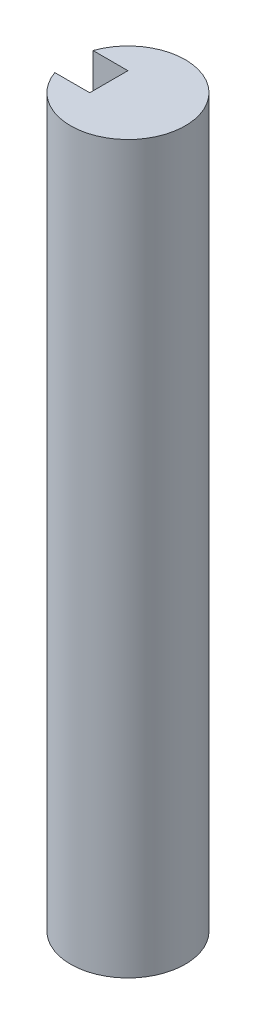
ISO-10303-21;
HEADER;
FILE_DESCRIPTION(('STEP AP214'),'2;1');
FILE_NAME('part.step','',(''),(''),'','','');
FILE_SCHEMA(('AUTOMOTIVE_DESIGN { 1 0 10303 214 1 1 1 1 }'));
ENDSEC;
DATA;
#1=APPLICATION_CONTEXT('core data for automotive mechanical design processes');
#2=APPLICATION_PROTOCOL_DEFINITION('international standard','automotive_design',2000,#1);
#3=PRODUCT_CONTEXT('',#1,'mechanical');
#4=PRODUCT('Part','Part','',(#3));
#5=PRODUCT_RELATED_PRODUCT_CATEGORY('part','',(#4));
#6=PRODUCT_DEFINITION_FORMATION('','',#4);
#7=PRODUCT_DEFINITION_CONTEXT('part definition',#1,'design');
#8=PRODUCT_DEFINITION('design','',#6,#7);
#9=PRODUCT_DEFINITION_SHAPE('','',#8);
#10=(LENGTH_UNIT() NAMED_UNIT(*) SI_UNIT(.MILLI.,.METRE.));
#11=(NAMED_UNIT(*) PLANE_ANGLE_UNIT() SI_UNIT($,.RADIAN.));
#12=(NAMED_UNIT(*) SI_UNIT($,.STERADIAN.) SOLID_ANGLE_UNIT());
#13=UNCERTAINTY_MEASURE_WITH_UNIT(LENGTH_MEASURE(1.E-05),#10,'distance_accuracy_value','');
#14=(GEOMETRIC_REPRESENTATION_CONTEXT(3) GLOBAL_UNCERTAINTY_ASSIGNED_CONTEXT((#13)) GLOBAL_UNIT_ASSIGNED_CONTEXT((#10,
#11,#12)) REPRESENTATION_CONTEXT('',''));
#15=CARTESIAN_POINT('',(0.,0.,0.));
#16=DIRECTION('',(0.,0.,1.));
#17=DIRECTION('',(1.,0.,0.));
#18=AXIS2_PLACEMENT_3D('',#15,#16,#17);
#19=CARTESIAN_POINT('',(1.5,19.,0.));
#20=DIRECTION('',(0.,-1.,0.));
#21=DIRECTION('',(0.,0.,-1.));
#22=AXIS2_PLACEMENT_3D('',#19,#20,#21);
#23=CYLINDRICAL_SURFACE('',#22,1.5);
#24=CARTESIAN_POINT('',(1.5,10.5,0.));
#25=DIRECTION('',(0.,-1.,0.));
#26=DIRECTION('',(0.,0.,-1.));
#27=AXIS2_PLACEMENT_3D('',#24,#25,#26);
#28=CIRCLE('',#27,1.5);
#29=CARTESIAN_POINT('',(0.0857864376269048,10.5,0.5));
#30=VERTEX_POINT('',#29);
#31=CARTESIAN_POINT('',(0.0857864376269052,10.5,-0.5));
#32=VERTEX_POINT('',#31);
#33=EDGE_CURVE('E201',#30,#32,#28,.T.);
#34=ORIENTED_EDGE('',*,*,#33,.F.);
#35=DIRECTION('',(0.,-1.,0.));
#36=VECTOR('',#35,1.);
#37=CARTESIAN_POINT('',(0.0857864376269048,19.,0.5));
#38=LINE('',#37,#36);
#39=CARTESIAN_POINT('',(0.0857864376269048,9.00000000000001,0.5));
#40=VERTEX_POINT('',#39);
#41=EDGE_CURVE('E210',#30,#40,#38,.T.);
#42=ORIENTED_EDGE('',*,*,#41,.T.);
#43=CARTESIAN_POINT('',(1.5,9.00000000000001,0.));
#44=DIRECTION('',(0.,-1.,0.));
#45=DIRECTION('',(0.,0.,-1.));
#46=AXIS2_PLACEMENT_3D('',#43,#44,#45);
#47=CIRCLE('',#46,1.5);
#48=CARTESIAN_POINT('',(0.0857864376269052,9.00000000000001,-0.5));
#49=VERTEX_POINT('',#48);
#50=EDGE_CURVE('E207',#40,#49,#47,.T.);
#51=ORIENTED_EDGE('',*,*,#50,.T.);
#52=DIRECTION('',(0.,-1.,0.));
#53=VECTOR('',#52,1.);
#54=CARTESIAN_POINT('',(0.0857864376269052,19.,-0.5));
#55=LINE('',#54,#53);
#56=EDGE_CURVE('E205',#32,#49,#55,.T.);
#57=ORIENTED_EDGE('',*,*,#56,.F.);
#58=EDGE_LOOP('',(#34,#42,#51,#57));
#59=FACE_BOUND('',#58,.T.);
#60=CARTESIAN_POINT('',(1.5,0.,0.));
#61=DIRECTION('',(0.,1.,0.));
#62=DIRECTION('',(0.,0.,1.));
#63=AXIS2_PLACEMENT_3D('',#60,#61,#62);
#64=CIRCLE('',#63,1.5);
#65=CARTESIAN_POINT('',(1.5,0.,1.5));
#66=VERTEX_POINT('',#65);
#67=EDGE_CURVE('E197',#66,#66,#64,.T.);
#68=ORIENTED_EDGE('',*,*,#67,.T.);
#69=EDGE_LOOP('',(#68));
#70=FACE_BOUND('',#69,.T.);
#71=CARTESIAN_POINT('',(1.5,13.5,0.));
#72=DIRECTION('',(0.,-1.,0.));
#73=DIRECTION('',(0.,0.,-1.));
#74=AXIS2_PLACEMENT_3D('',#71,#72,#73);
#75=CIRCLE('',#74,1.5);
#76=CARTESIAN_POINT('',(0.0857864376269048,13.5,0.5));
#77=VERTEX_POINT('',#76);
#78=CARTESIAN_POINT('',(0.0857864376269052,13.5,-0.5));
#79=VERTEX_POINT('',#78);
#80=EDGE_CURVE('E213',#77,#79,#75,.T.);
#81=ORIENTED_EDGE('',*,*,#80,.F.);
#82=DIRECTION('',(0.,-1.,0.));
#83=VECTOR('',#82,1.);
#84=CARTESIAN_POINT('',(0.0857864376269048,19.,0.5));
#85=LINE('',#84,#83);
#86=CARTESIAN_POINT('',(0.0857864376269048,12.,0.5));
#87=VERTEX_POINT('',#86);
#88=EDGE_CURVE('E44',#77,#87,#85,.T.);
#89=ORIENTED_EDGE('',*,*,#88,.T.);
#90=CARTESIAN_POINT('',(1.5,12.,0.));
#91=DIRECTION('',(0.,-1.,0.));
#92=DIRECTION('',(0.,0.,-1.));
#93=AXIS2_PLACEMENT_3D('',#90,#91,#92);
#94=CIRCLE('',#93,1.5);
#95=CARTESIAN_POINT('',(0.0857864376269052,12.,-0.5));
#96=VERTEX_POINT('',#95);
#97=EDGE_CURVE('E59',#87,#96,#94,.T.);
#98=ORIENTED_EDGE('',*,*,#97,.T.);
#99=DIRECTION('',(0.,-1.,0.));
#100=VECTOR('',#99,1.);
#101=CARTESIAN_POINT('',(0.0857864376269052,19.,-0.5));
#102=LINE('',#101,#100);
#103=EDGE_CURVE('E215',#79,#96,#102,.T.);
#104=ORIENTED_EDGE('',*,*,#103,.F.);
#105=EDGE_LOOP('',(#81,#89,#98,#104));
#106=FACE_BOUND('',#105,.T.);
#107=CARTESIAN_POINT('',(1.5,17.5,0.));
#108=DIRECTION('',(0.,1.,0.));
#109=DIRECTION('',(0.,0.,1.));
#110=AXIS2_PLACEMENT_3D('',#107,#108,#109);
#111=CIRCLE('',#110,1.5);
#112=CARTESIAN_POINT('',(0.085786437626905,17.5,-0.5));
#113=VERTEX_POINT('',#112);
#114=CARTESIAN_POINT('',(0.0857864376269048,17.5,0.5));
#115=VERTEX_POINT('',#114);
#116=EDGE_CURVE('E11',#113,#115,#111,.T.);
#117=ORIENTED_EDGE('',*,*,#116,.F.);
#118=DIRECTION('',(0.,-1.,0.));
#119=VECTOR('',#118,1.);
#120=CARTESIAN_POINT('',(0.085786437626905,19.,-0.5));
#121=LINE('',#120,#119);
#122=CARTESIAN_POINT('',(0.085786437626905,19.,-0.5));
#123=VERTEX_POINT('',#122);
#124=EDGE_CURVE('E150',#113,#123,#121,.F.);
#125=ORIENTED_EDGE('',*,*,#124,.T.);
#126=CARTESIAN_POINT('',(1.5,19.,0.));
#127=DIRECTION('',(0.,1.,0.));
#128=DIRECTION('',(0.,0.,1.));
#129=AXIS2_PLACEMENT_3D('',#126,#127,#128);
#130=CIRCLE('',#129,1.5);
#131=CARTESIAN_POINT('',(0.085786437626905,19.,0.5));
#132=VERTEX_POINT('',#131);
#133=EDGE_CURVE('E198',#132,#123,#130,.T.);
#134=ORIENTED_EDGE('',*,*,#133,.F.);
#135=DIRECTION('',(0.,-1.,0.));
#136=VECTOR('',#135,1.);
#137=CARTESIAN_POINT('',(0.085786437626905,19.,0.5));
#138=LINE('',#137,#136);
#139=EDGE_CURVE('E153',#115,#132,#138,.F.);
#140=ORIENTED_EDGE('',*,*,#139,.F.);
#141=EDGE_LOOP('',(#117,#125,#134,#140));
#142=FACE_BOUND('',#141,.T.);
#143=ADVANCED_FACE('F37',(#59,#70,#106,#142),#23,.T.);
#144=CARTESIAN_POINT('',(1.5,19.,0.));
#145=DIRECTION('',(0.,1.,0.));
#146=DIRECTION('',(0.,0.,1.));
#147=AXIS2_PLACEMENT_3D('',#144,#145,#146);
#148=PLANE('',#147);
#149=DIRECTION('',(0.,0.,-1.));
#150=VECTOR('',#149,1.);
#151=CARTESIAN_POINT('',(1.,19.,0.5));
#152=LINE('',#151,#150);
#153=CARTESIAN_POINT('',(1.,19.,0.5));
#154=VERTEX_POINT('',#153);
#155=CARTESIAN_POINT('',(1.,19.,-0.5));
#156=VERTEX_POINT('',#155);
#157=EDGE_CURVE('E145',#154,#156,#152,.T.);
#158=ORIENTED_EDGE('',*,*,#157,.F.);
#159=DIRECTION('',(-1.,0.,0.));
#160=VECTOR('',#159,1.);
#161=CARTESIAN_POINT('',(1.,19.,0.5));
#162=LINE('',#161,#160);
#163=EDGE_CURVE('E130',#154,#132,#162,.T.);
#164=ORIENTED_EDGE('',*,*,#163,.T.);
#165=ORIENTED_EDGE('',*,*,#133,.T.);
#166=DIRECTION('',(-1.,0.,0.));
#167=VECTOR('',#166,1.);
#168=CARTESIAN_POINT('',(1.,19.,-0.5));
#169=LINE('',#168,#167);
#170=EDGE_CURVE('E133',#156,#123,#169,.T.);
#171=ORIENTED_EDGE('',*,*,#170,.F.);
#172=EDGE_LOOP('',(#158,#164,#165,#171));
#173=FACE_BOUND('',#172,.T.);
#174=ADVANCED_FACE('F248',(#173),#148,.T.);
#175=CARTESIAN_POINT('',(1.5,0.,0.));
#176=DIRECTION('',(0.,1.,0.));
#177=DIRECTION('',(0.,0.,1.));
#178=AXIS2_PLACEMENT_3D('',#175,#176,#177);
#179=PLANE('',#178);
#180=ORIENTED_EDGE('',*,*,#67,.F.);
#181=EDGE_LOOP('',(#180));
#182=FACE_BOUND('',#181,.T.);
#183=ADVANCED_FACE('F253',(#182),#179,.F.);
#184=CARTESIAN_POINT('',(1.,0.,0.5));
#185=DIRECTION('',(0.,0.,1.));
#186=DIRECTION('',(1.,0.,0.));
#187=AXIS2_PLACEMENT_3D('',#184,#185,#186);
#188=PLANE('',#187);
#189=DIRECTION('',(-1.,0.,0.));
#190=VECTOR('',#189,1.);
#191=CARTESIAN_POINT('',(1.,10.5,0.5));
#192=LINE('',#191,#190);
#193=CARTESIAN_POINT('',(1.,10.5,0.5));
#194=VERTEX_POINT('',#193);
#195=EDGE_CURVE('E185',#194,#30,#192,.T.);
#196=ORIENTED_EDGE('',*,*,#195,.F.);
#197=DIRECTION('',(0.,1.,0.));
#198=VECTOR('',#197,1.);
#199=CARTESIAN_POINT('',(1.,0.,0.5));
#200=LINE('',#199,#198);
#201=CARTESIAN_POINT('',(1.,9.00000000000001,0.5));
#202=VERTEX_POINT('',#201);
#203=EDGE_CURVE('E175',#202,#194,#200,.T.);
#204=ORIENTED_EDGE('',*,*,#203,.F.);
#205=DIRECTION('',(-1.,0.,0.));
#206=VECTOR('',#205,1.);
#207=CARTESIAN_POINT('',(1.,9.00000000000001,0.5));
#208=LINE('',#207,#206);
#209=EDGE_CURVE('E194',#202,#40,#208,.T.);
#210=ORIENTED_EDGE('',*,*,#209,.T.);
#211=ORIENTED_EDGE('',*,*,#41,.F.);
#212=EDGE_LOOP('',(#196,#204,#210,#211));
#213=FACE_BOUND('',#212,.T.);
#214=ADVANCED_FACE('F262',(#213),#188,.F.);
#215=CARTESIAN_POINT('',(1.,9.00000000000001,0.));
#216=DIRECTION('',(0.,-1.,0.));
#217=DIRECTION('',(0.,0.,-1.));
#218=AXIS2_PLACEMENT_3D('',#215,#216,#217);
#219=PLANE('',#218);
#220=ORIENTED_EDGE('',*,*,#209,.F.);
#221=DIRECTION('',(0.,0.,1.));
#222=VECTOR('',#221,1.);
#223=CARTESIAN_POINT('',(1.,9.00000000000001,0.));
#224=LINE('',#223,#222);
#225=CARTESIAN_POINT('',(1.,9.00000000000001,-0.5));
#226=VERTEX_POINT('',#225);
#227=EDGE_CURVE('E178',#226,#202,#224,.T.);
#228=ORIENTED_EDGE('',*,*,#227,.F.);
#229=DIRECTION('',(-1.,0.,0.));
#230=VECTOR('',#229,1.);
#231=CARTESIAN_POINT('',(1.,9.00000000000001,-0.5));
#232=LINE('',#231,#230);
#233=EDGE_CURVE('E191',#226,#49,#232,.T.);
#234=ORIENTED_EDGE('',*,*,#233,.T.);
#235=ORIENTED_EDGE('',*,*,#50,.F.);
#236=EDGE_LOOP('',(#220,#228,#234,#235));
#237=FACE_BOUND('',#236,.T.);
#238=ADVANCED_FACE('F266',(#237),#219,.F.);
#239=CARTESIAN_POINT('',(1.,0.,-0.5));
#240=DIRECTION('',(0.,0.,1.));
#241=DIRECTION('',(1.,0.,0.));
#242=AXIS2_PLACEMENT_3D('',#239,#240,#241);
#243=PLANE('',#242);
#244=ORIENTED_EDGE('',*,*,#56,.T.);
#245=ORIENTED_EDGE('',*,*,#233,.F.);
#246=DIRECTION('',(0.,1.,0.));
#247=VECTOR('',#246,1.);
#248=CARTESIAN_POINT('',(1.,0.,-0.5));
#249=LINE('',#248,#247);
#250=CARTESIAN_POINT('',(1.,10.5,-0.5));
#251=VERTEX_POINT('',#250);
#252=EDGE_CURVE('E181',#226,#251,#249,.T.);
#253=ORIENTED_EDGE('',*,*,#252,.T.);
#254=DIRECTION('',(-1.,0.,0.));
#255=VECTOR('',#254,1.);
#256=CARTESIAN_POINT('',(1.,10.5,-0.5));
#257=LINE('',#256,#255);
#258=EDGE_CURVE('E188',#251,#32,#257,.T.);
#259=ORIENTED_EDGE('',*,*,#258,.T.);
#260=EDGE_LOOP('',(#244,#245,#253,#259));
#261=FACE_BOUND('',#260,.T.);
#262=ADVANCED_FACE('F272',(#261),#243,.T.);
#263=CARTESIAN_POINT('',(1.,10.5,0.));
#264=DIRECTION('',(0.,-1.,0.));
#265=DIRECTION('',(0.,0.,-1.));
#266=AXIS2_PLACEMENT_3D('',#263,#264,#265);
#267=PLANE('',#266);
#268=ORIENTED_EDGE('',*,*,#195,.T.);
#269=ORIENTED_EDGE('',*,*,#33,.T.);
#270=ORIENTED_EDGE('',*,*,#258,.F.);
#271=DIRECTION('',(0.,0.,1.));
#272=VECTOR('',#271,1.);
#273=CARTESIAN_POINT('',(1.,10.5,0.));
#274=LINE('',#273,#272);
#275=EDGE_CURVE('E183',#251,#194,#274,.T.);
#276=ORIENTED_EDGE('',*,*,#275,.T.);
#277=EDGE_LOOP('',(#268,#269,#270,#276));
#278=FACE_BOUND('',#277,.T.);
#279=ADVANCED_FACE('F276',(#278),#267,.T.);
#280=CARTESIAN_POINT('',(1.,0.,0.));
#281=DIRECTION('',(1.,0.,0.));
#282=DIRECTION('',(0.,0.,-1.));
#283=AXIS2_PLACEMENT_3D('',#280,#281,#282);
#284=PLANE('',#283);
#285=ORIENTED_EDGE('',*,*,#203,.T.);
#286=ORIENTED_EDGE('',*,*,#275,.F.);
#287=ORIENTED_EDGE('',*,*,#252,.F.);
#288=ORIENTED_EDGE('',*,*,#227,.T.);
#289=EDGE_LOOP('',(#285,#286,#287,#288));
#290=FACE_BOUND('',#289,.T.);
#291=ADVANCED_FACE('F244',(#290),#284,.F.);
#292=CARTESIAN_POINT('',(1.,12.,-0.5));
#293=DIRECTION('',(0.,-1.,0.));
#294=DIRECTION('',(0.,0.,-1.));
#295=AXIS2_PLACEMENT_3D('',#292,#293,#294);
#296=PLANE('',#295);
#297=DIRECTION('',(-1.,0.,0.));
#298=VECTOR('',#297,1.);
#299=CARTESIAN_POINT('',(1.,12.,0.5));
#300=LINE('',#299,#298);
#301=CARTESIAN_POINT('',(1.,12.,0.5));
#302=VERTEX_POINT('',#301);
#303=EDGE_CURVE('E156',#302,#87,#300,.T.);
#304=ORIENTED_EDGE('',*,*,#303,.F.);
#305=DIRECTION('',(0.,0.,1.));
#306=VECTOR('',#305,1.);
#307=CARTESIAN_POINT('',(1.,12.,-0.5));
#308=LINE('',#307,#306);
#309=CARTESIAN_POINT('',(1.,12.,-0.5));
#310=VERTEX_POINT('',#309);
#311=EDGE_CURVE('E172',#310,#302,#308,.T.);
#312=ORIENTED_EDGE('',*,*,#311,.F.);
#313=DIRECTION('',(-1.,0.,0.));
#314=VECTOR('',#313,1.);
#315=CARTESIAN_POINT('',(1.,12.,-0.5));
#316=LINE('',#315,#314);
#317=EDGE_CURVE('E155',#310,#96,#316,.T.);
#318=ORIENTED_EDGE('',*,*,#317,.T.);
#319=ORIENTED_EDGE('',*,*,#97,.F.);
#320=EDGE_LOOP('',(#304,#312,#318,#319));
#321=FACE_BOUND('',#320,.T.);
#322=ADVANCED_FACE('F234',(#321),#296,.F.);
#323=CARTESIAN_POINT('',(1.,12.,-0.5));
#324=DIRECTION('',(0.,0.,1.));
#325=DIRECTION('',(1.,0.,0.));
#326=AXIS2_PLACEMENT_3D('',#323,#324,#325);
#327=PLANE('',#326);
#328=ORIENTED_EDGE('',*,*,#103,.T.);
#329=ORIENTED_EDGE('',*,*,#317,.F.);
#330=DIRECTION('',(0.,1.,0.));
#331=VECTOR('',#330,1.);
#332=CARTESIAN_POINT('',(1.,12.,-0.5));
#333=LINE('',#332,#331);
#334=CARTESIAN_POINT('',(1.,13.5,-0.5));
#335=VERTEX_POINT('',#334);
#336=EDGE_CURVE('E158',#310,#335,#333,.T.);
#337=ORIENTED_EDGE('',*,*,#336,.T.);
#338=DIRECTION('',(-1.,0.,0.));
#339=VECTOR('',#338,1.);
#340=CARTESIAN_POINT('',(1.,13.5,-0.5));
#341=LINE('',#340,#339);
#342=EDGE_CURVE('E162',#335,#79,#341,.T.);
#343=ORIENTED_EDGE('',*,*,#342,.T.);
#344=EDGE_LOOP('',(#328,#329,#337,#343));
#345=FACE_BOUND('',#344,.T.);
#346=ADVANCED_FACE('F236',(#345),#327,.T.);
#347=CARTESIAN_POINT('',(1.,13.5,-0.5));
#348=DIRECTION('',(0.,-1.,0.));
#349=DIRECTION('',(0.,0.,-1.));
#350=AXIS2_PLACEMENT_3D('',#347,#348,#349);
#351=PLANE('',#350);
#352=DIRECTION('',(-1.,0.,0.));
#353=VECTOR('',#352,1.);
#354=CARTESIAN_POINT('',(1.,13.5,0.5));
#355=LINE('',#354,#353);
#356=CARTESIAN_POINT('',(1.,13.5,0.5));
#357=VERTEX_POINT('',#356);
#358=EDGE_CURVE('E159',#357,#77,#355,.T.);
#359=ORIENTED_EDGE('',*,*,#358,.T.);
#360=ORIENTED_EDGE('',*,*,#80,.T.);
#361=ORIENTED_EDGE('',*,*,#342,.F.);
#362=DIRECTION('',(0.,0.,1.));
#363=VECTOR('',#362,1.);
#364=CARTESIAN_POINT('',(1.,13.5,-0.5));
#365=LINE('',#364,#363);
#366=EDGE_CURVE('E167',#335,#357,#365,.T.);
#367=ORIENTED_EDGE('',*,*,#366,.T.);
#368=EDGE_LOOP('',(#359,#360,#361,#367));
#369=FACE_BOUND('',#368,.T.);
#370=ADVANCED_FACE('F227',(#369),#351,.T.);
#371=CARTESIAN_POINT('',(1.,12.,0.5));
#372=DIRECTION('',(0.,0.,1.));
#373=DIRECTION('',(1.,0.,0.));
#374=AXIS2_PLACEMENT_3D('',#371,#372,#373);
#375=PLANE('',#374);
#376=ORIENTED_EDGE('',*,*,#358,.F.);
#377=DIRECTION('',(0.,1.,0.));
#378=VECTOR('',#377,1.);
#379=CARTESIAN_POINT('',(1.,12.,0.5));
#380=LINE('',#379,#378);
#381=EDGE_CURVE('E169',#302,#357,#380,.T.);
#382=ORIENTED_EDGE('',*,*,#381,.F.);
#383=ORIENTED_EDGE('',*,*,#303,.T.);
#384=ORIENTED_EDGE('',*,*,#88,.F.);
#385=EDGE_LOOP('',(#376,#382,#383,#384));
#386=FACE_BOUND('',#385,.T.);
#387=ADVANCED_FACE('F224',(#386),#375,.F.);
#388=CARTESIAN_POINT('',(1.,0.,0.));
#389=DIRECTION('',(-1.,0.,0.));
#390=DIRECTION('',(0.,0.,1.));
#391=AXIS2_PLACEMENT_3D('',#388,#389,#390);
#392=PLANE('',#391);
#393=ORIENTED_EDGE('',*,*,#311,.T.);
#394=ORIENTED_EDGE('',*,*,#381,.T.);
#395=ORIENTED_EDGE('',*,*,#366,.F.);
#396=ORIENTED_EDGE('',*,*,#336,.F.);
#397=EDGE_LOOP('',(#393,#394,#395,#396));
#398=FACE_BOUND('',#397,.T.);
#399=ADVANCED_FACE('F232',(#398),#392,.T.);
#400=CARTESIAN_POINT('',(1.,17.5,0.5));
#401=DIRECTION('',(0.,1.,0.));
#402=DIRECTION('',(0.,0.,1.));
#403=AXIS2_PLACEMENT_3D('',#400,#401,#402);
#404=PLANE('',#403);
#405=DIRECTION('',(-1.,0.,0.));
#406=VECTOR('',#405,1.);
#407=CARTESIAN_POINT('',(1.,17.5,-0.5));
#408=LINE('',#407,#406);
#409=CARTESIAN_POINT('',(1.,17.5,-0.5));
#410=VERTEX_POINT('',#409);
#411=EDGE_CURVE('E139',#410,#113,#408,.T.);
#412=ORIENTED_EDGE('',*,*,#411,.T.);
#413=ORIENTED_EDGE('',*,*,#116,.T.);
#414=DIRECTION('',(-1.,0.,0.));
#415=VECTOR('',#414,1.);
#416=CARTESIAN_POINT('',(1.,17.5,0.5));
#417=LINE('',#416,#415);
#418=CARTESIAN_POINT('',(1.,17.5,0.5));
#419=VERTEX_POINT('',#418);
#420=EDGE_CURVE('E127',#419,#115,#417,.T.);
#421=ORIENTED_EDGE('',*,*,#420,.F.);
#422=DIRECTION('',(0.,0.,-1.));
#423=VECTOR('',#422,1.);
#424=CARTESIAN_POINT('',(1.,17.5,0.5));
#425=LINE('',#424,#423);
#426=EDGE_CURVE('E132',#419,#410,#425,.T.);
#427=ORIENTED_EDGE('',*,*,#426,.T.);
#428=EDGE_LOOP('',(#412,#413,#421,#427));
#429=FACE_BOUND('',#428,.T.);
#430=ADVANCED_FACE('F137',(#429),#404,.T.);
#431=CARTESIAN_POINT('',(1.,19.,0.5));
#432=DIRECTION('',(0.,0.,-1.));
#433=DIRECTION('',(0.,1.,0.));
#434=AXIS2_PLACEMENT_3D('',#431,#432,#433);
#435=PLANE('',#434);
#436=ORIENTED_EDGE('',*,*,#139,.T.);
#437=ORIENTED_EDGE('',*,*,#163,.F.);
#438=DIRECTION('',(0.,-1.,0.));
#439=VECTOR('',#438,1.);
#440=CARTESIAN_POINT('',(1.,19.,0.5));
#441=LINE('',#440,#439);
#442=EDGE_CURVE('E51',#154,#419,#441,.T.);
#443=ORIENTED_EDGE('',*,*,#442,.T.);
#444=ORIENTED_EDGE('',*,*,#420,.T.);
#445=EDGE_LOOP('',(#436,#437,#443,#444));
#446=FACE_BOUND('',#445,.T.);
#447=ADVANCED_FACE('F126',(#446),#435,.T.);
#448=CARTESIAN_POINT('',(1.,19.,-0.5));
#449=DIRECTION('',(0.,0.,-1.));
#450=DIRECTION('',(0.,1.,0.));
#451=AXIS2_PLACEMENT_3D('',#448,#449,#450);
#452=PLANE('',#451);
#453=ORIENTED_EDGE('',*,*,#411,.F.);
#454=DIRECTION('',(0.,-1.,0.));
#455=VECTOR('',#454,1.);
#456=CARTESIAN_POINT('',(1.,19.,-0.5));
#457=LINE('',#456,#455);
#458=EDGE_CURVE('E143',#156,#410,#457,.T.);
#459=ORIENTED_EDGE('',*,*,#458,.F.);
#460=ORIENTED_EDGE('',*,*,#170,.T.);
#461=ORIENTED_EDGE('',*,*,#124,.F.);
#462=EDGE_LOOP('',(#453,#459,#460,#461));
#463=FACE_BOUND('',#462,.T.);
#464=ADVANCED_FACE('F295',(#463),#452,.F.);
#465=CARTESIAN_POINT('',(1.,0.,0.));
#466=DIRECTION('',(-1.,0.,0.));
#467=DIRECTION('',(0.,0.,1.));
#468=AXIS2_PLACEMENT_3D('',#465,#466,#467);
#469=PLANE('',#468);
#470=ORIENTED_EDGE('',*,*,#157,.T.);
#471=ORIENTED_EDGE('',*,*,#458,.T.);
#472=ORIENTED_EDGE('',*,*,#426,.F.);
#473=ORIENTED_EDGE('',*,*,#442,.F.);
#474=EDGE_LOOP('',(#470,#471,#472,#473));
#475=FACE_BOUND('',#474,.T.);
#476=ADVANCED_FACE('F142',(#475),#469,.T.);
#477=CLOSED_SHELL('',(#143,#174,#183,#214,#238,#262,#279,#291,#322,#346,#370,#387,#399,#430,
#447,#464,#476));
#478=MANIFOLD_SOLID_BREP('B2',#477);
#479=ADVANCED_BREP_SHAPE_REPRESENTATION('',(#18,#478),#14);
#480=SHAPE_DEFINITION_REPRESENTATION(#9,#479);
ENDSEC;
END-ISO-10303-21;
